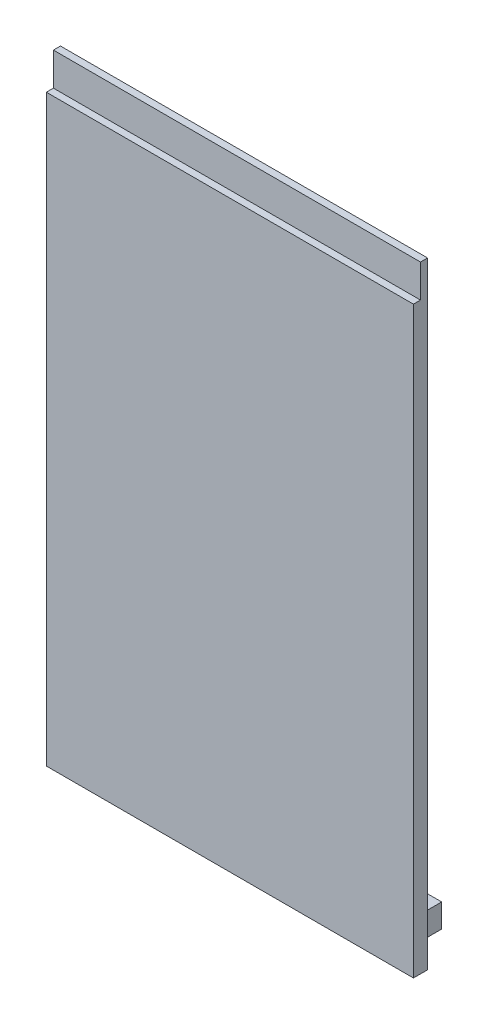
ISO-10303-21;
HEADER;
FILE_DESCRIPTION(('STEP AP214'),'2;1');
FILE_NAME('part.step','',(''),(''),'','','');
FILE_SCHEMA(('AUTOMOTIVE_DESIGN { 1 0 10303 214 1 1 1 1 }'));
ENDSEC;
DATA;
#1=APPLICATION_CONTEXT('core data for automotive mechanical design processes');
#2=APPLICATION_PROTOCOL_DEFINITION('international standard','automotive_design',2000,#1);
#3=PRODUCT_CONTEXT('',#1,'mechanical');
#4=PRODUCT('Part','Part','',(#3));
#5=PRODUCT_RELATED_PRODUCT_CATEGORY('part','',(#4));
#6=PRODUCT_DEFINITION_FORMATION('','',#4);
#7=PRODUCT_DEFINITION_CONTEXT('part definition',#1,'design');
#8=PRODUCT_DEFINITION('design','',#6,#7);
#9=PRODUCT_DEFINITION_SHAPE('','',#8);
#10=(LENGTH_UNIT() NAMED_UNIT(*) SI_UNIT(.MILLI.,.METRE.));
#11=(NAMED_UNIT(*) PLANE_ANGLE_UNIT() SI_UNIT($,.RADIAN.));
#12=(NAMED_UNIT(*) SI_UNIT($,.STERADIAN.) SOLID_ANGLE_UNIT());
#13=UNCERTAINTY_MEASURE_WITH_UNIT(LENGTH_MEASURE(1.E-05),#10,'distance_accuracy_value','');
#14=(GEOMETRIC_REPRESENTATION_CONTEXT(3) GLOBAL_UNCERTAINTY_ASSIGNED_CONTEXT((#13)) GLOBAL_UNIT_ASSIGNED_CONTEXT((#10,
#11,#12)) REPRESENTATION_CONTEXT('',''));
#15=CARTESIAN_POINT('',(0.,0.,0.));
#16=DIRECTION('',(0.,0.,1.));
#17=DIRECTION('',(1.,0.,0.));
#18=AXIS2_PLACEMENT_3D('',#15,#16,#17);
#19=CARTESIAN_POINT('',(0.,0.,0.));
#20=DIRECTION('',(0.,0.,1.));
#21=DIRECTION('',(1.,0.,0.));
#22=AXIS2_PLACEMENT_3D('',#19,#20,#21);
#23=PLANE('',#22);
#24=DIRECTION('',(-1.,0.,0.));
#25=VECTOR('',#24,1.);
#26=CARTESIAN_POINT('',(39.,-116.5,0.));
#27=LINE('',#26,#25);
#28=CARTESIAN_POINT('',(36.,-116.5,0.));
#29=VERTEX_POINT('',#28);
#30=CARTESIAN_POINT('',(-36.,-116.5,0.));
#31=VERTEX_POINT('',#30);
#32=EDGE_CURVE('E163',#29,#31,#27,.T.);
#33=ORIENTED_EDGE('',*,*,#32,.T.);
#34=DIRECTION('',(0.,-1.,0.));
#35=VECTOR('',#34,1.);
#36=CARTESIAN_POINT('',(-36.,124.5,0.));
#37=LINE('',#36,#35);
#38=CARTESIAN_POINT('',(-36.,-121.5,0.));
#39=VERTEX_POINT('',#38);
#40=EDGE_CURVE('E161',#31,#39,#37,.T.);
#41=ORIENTED_EDGE('',*,*,#40,.T.);
#42=DIRECTION('',(-1.,0.,0.));
#43=VECTOR('',#42,1.);
#44=CARTESIAN_POINT('',(39.,-121.5,0.));
#45=LINE('',#44,#43);
#46=CARTESIAN_POINT('',(36.,-121.5,0.));
#47=VERTEX_POINT('',#46);
#48=EDGE_CURVE('E169',#47,#39,#45,.T.);
#49=ORIENTED_EDGE('',*,*,#48,.F.);
#50=DIRECTION('',(0.,-1.,0.));
#51=VECTOR('',#50,1.);
#52=CARTESIAN_POINT('',(36.,124.5,0.));
#53=LINE('',#52,#51);
#54=EDGE_CURVE('E165',#29,#47,#53,.T.);
#55=ORIENTED_EDGE('',*,*,#54,.F.);
#56=EDGE_LOOP('',(#33,#41,#49,#55));
#57=FACE_BOUND('',#56,.T.);
#58=DIRECTION('',(0.,-1.,0.));
#59=VECTOR('',#58,1.);
#60=CARTESIAN_POINT('',(-39.,124.5,0.));
#61=LINE('',#60,#59);
#62=CARTESIAN_POINT('',(-39.,6.49999999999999,0.));
#63=VERTEX_POINT('',#62);
#64=CARTESIAN_POINT('',(-39.,-124.5,0.));
#65=VERTEX_POINT('',#64);
#66=EDGE_CURVE('E190',#63,#65,#61,.T.);
#67=ORIENTED_EDGE('',*,*,#66,.F.);
#68=DIRECTION('',(-1.,0.,0.));
#69=VECTOR('',#68,1.);
#70=CARTESIAN_POINT('',(39.,6.50000000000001,0.));
#71=LINE('',#70,#69);
#72=CARTESIAN_POINT('',(39.,6.50000000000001,0.));
#73=VERTEX_POINT('',#72);
#74=EDGE_CURVE('E122',#73,#63,#71,.T.);
#75=ORIENTED_EDGE('',*,*,#74,.F.);
#76=DIRECTION('',(0.,1.,0.));
#77=VECTOR('',#76,1.);
#78=CARTESIAN_POINT('',(39.,124.5,0.));
#79=LINE('',#78,#77);
#80=CARTESIAN_POINT('',(39.,-124.5,0.));
#81=VERTEX_POINT('',#80);
#82=EDGE_CURVE('E135',#81,#73,#79,.T.);
#83=ORIENTED_EDGE('',*,*,#82,.F.);
#84=DIRECTION('',(1.,0.,0.));
#85=VECTOR('',#84,1.);
#86=CARTESIAN_POINT('',(-39.,-124.5,0.));
#87=LINE('',#86,#85);
#88=EDGE_CURVE('E184',#65,#81,#87,.T.);
#89=ORIENTED_EDGE('',*,*,#88,.F.);
#90=EDGE_LOOP('',(#67,#75,#83,#89));
#91=FACE_BOUND('',#90,.T.);
#92=ADVANCED_FACE('F37',(#57,#91),#23,.F.);
#93=CARTESIAN_POINT('',(39.,124.5,3.));
#94=DIRECTION('',(-1.,0.,0.));
#95=DIRECTION('',(0.,-1.,0.));
#96=AXIS2_PLACEMENT_3D('',#93,#94,#95);
#97=PLANE('',#96);
#98=DIRECTION('',(0.,-1.,0.));
#99=VECTOR('',#98,1.);
#100=CARTESIAN_POINT('',(39.,-0.499999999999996,1.5));
#101=LINE('',#100,#99);
#102=CARTESIAN_POINT('',(39.,6.50000000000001,1.5));
#103=VERTEX_POINT('',#102);
#104=CARTESIAN_POINT('',(39.,-0.499999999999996,1.5));
#105=VERTEX_POINT('',#104);
#106=EDGE_CURVE('E125',#103,#105,#101,.T.);
#107=ORIENTED_EDGE('',*,*,#106,.T.);
#108=DIRECTION('',(0.,0.,1.));
#109=VECTOR('',#108,1.);
#110=CARTESIAN_POINT('',(39.,-0.499999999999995,3.));
#111=LINE('',#110,#109);
#112=CARTESIAN_POINT('',(39.,-0.499999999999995,3.));
#113=VERTEX_POINT('',#112);
#114=EDGE_CURVE('E130',#105,#113,#111,.T.);
#115=ORIENTED_EDGE('',*,*,#114,.T.);
#116=DIRECTION('',(0.,1.,0.));
#117=VECTOR('',#116,1.);
#118=CARTESIAN_POINT('',(39.,124.5,3.));
#119=LINE('',#118,#117);
#120=CARTESIAN_POINT('',(39.,-124.5,3.));
#121=VERTEX_POINT('',#120);
#122=EDGE_CURVE('E180',#121,#113,#119,.T.);
#123=ORIENTED_EDGE('',*,*,#122,.F.);
#124=DIRECTION('',(0.,0.,-1.));
#125=VECTOR('',#124,1.);
#126=CARTESIAN_POINT('',(39.,-124.5,3.));
#127=LINE('',#126,#125);
#128=EDGE_CURVE('E188',#121,#81,#127,.T.);
#129=ORIENTED_EDGE('',*,*,#128,.T.);
#130=ORIENTED_EDGE('',*,*,#82,.T.);
#131=DIRECTION('',(0.,0.,1.));
#132=VECTOR('',#131,1.);
#133=CARTESIAN_POINT('',(39.,6.50000000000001,1.5));
#134=LINE('',#133,#132);
#135=EDGE_CURVE('E54',#73,#103,#134,.T.);
#136=ORIENTED_EDGE('',*,*,#135,.T.);
#137=EDGE_LOOP('',(#107,#115,#123,#129,#130,#136));
#138=FACE_BOUND('',#137,.T.);
#139=ADVANCED_FACE('F39',(#138),#97,.F.);
#140=CARTESIAN_POINT('',(-39.,124.5,3.));
#141=DIRECTION('',(1.,0.,0.));
#142=DIRECTION('',(0.,1.,0.));
#143=AXIS2_PLACEMENT_3D('',#140,#141,#142);
#144=PLANE('',#143);
#145=DIRECTION('',(0.,-1.,0.));
#146=VECTOR('',#145,1.);
#147=CARTESIAN_POINT('',(-39.,124.5,3.));
#148=LINE('',#147,#146);
#149=CARTESIAN_POINT('',(-39.,-0.500000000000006,3.));
#150=VERTEX_POINT('',#149);
#151=CARTESIAN_POINT('',(-39.,-124.5,3.));
#152=VERTEX_POINT('',#151);
#153=EDGE_CURVE('E183',#150,#152,#148,.T.);
#154=ORIENTED_EDGE('',*,*,#153,.F.);
#155=DIRECTION('',(0.,0.,1.));
#156=VECTOR('',#155,1.);
#157=CARTESIAN_POINT('',(-39.,-0.500000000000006,3.));
#158=LINE('',#157,#156);
#159=CARTESIAN_POINT('',(-39.,-0.500000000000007,1.5));
#160=VERTEX_POINT('',#159);
#161=EDGE_CURVE('E136',#160,#150,#158,.T.);
#162=ORIENTED_EDGE('',*,*,#161,.F.);
#163=DIRECTION('',(0.,-1.,0.));
#164=VECTOR('',#163,1.);
#165=CARTESIAN_POINT('',(-39.,-0.500000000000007,1.5));
#166=LINE('',#165,#164);
#167=CARTESIAN_POINT('',(-39.,6.49999999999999,1.5));
#168=VERTEX_POINT('',#167);
#169=EDGE_CURVE('E138',#168,#160,#166,.T.);
#170=ORIENTED_EDGE('',*,*,#169,.F.);
#171=DIRECTION('',(0.,0.,1.));
#172=VECTOR('',#171,1.);
#173=CARTESIAN_POINT('',(-39.,6.49999999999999,1.5));
#174=LINE('',#173,#172);
#175=EDGE_CURVE('E117',#63,#168,#174,.T.);
#176=ORIENTED_EDGE('',*,*,#175,.F.);
#177=ORIENTED_EDGE('',*,*,#66,.T.);
#178=DIRECTION('',(0.,0.,-1.));
#179=VECTOR('',#178,1.);
#180=CARTESIAN_POINT('',(-39.,-124.5,3.));
#181=LINE('',#180,#179);
#182=EDGE_CURVE('E194',#152,#65,#181,.T.);
#183=ORIENTED_EDGE('',*,*,#182,.F.);
#184=EDGE_LOOP('',(#154,#162,#170,#176,#177,#183));
#185=FACE_BOUND('',#184,.T.);
#186=ADVANCED_FACE('F244',(#185),#144,.F.);
#187=CARTESIAN_POINT('',(-39.,-124.5,3.));
#188=DIRECTION('',(0.,1.,0.));
#189=DIRECTION('',(0.,0.,1.));
#190=AXIS2_PLACEMENT_3D('',#187,#188,#189);
#191=PLANE('',#190);
#192=ORIENTED_EDGE('',*,*,#88,.T.);
#193=ORIENTED_EDGE('',*,*,#128,.F.);
#194=DIRECTION('',(1.,0.,0.));
#195=VECTOR('',#194,1.);
#196=CARTESIAN_POINT('',(-39.,-124.5,3.));
#197=LINE('',#196,#195);
#198=EDGE_CURVE('E186',#152,#121,#197,.T.);
#199=ORIENTED_EDGE('',*,*,#198,.F.);
#200=ORIENTED_EDGE('',*,*,#182,.T.);
#201=EDGE_LOOP('',(#192,#193,#199,#200));
#202=FACE_BOUND('',#201,.T.);
#203=ADVANCED_FACE('F248',(#202),#191,.F.);
#204=CARTESIAN_POINT('',(0.,0.,3.));
#205=DIRECTION('',(0.,0.,1.));
#206=DIRECTION('',(1.,0.,0.));
#207=AXIS2_PLACEMENT_3D('',#204,#205,#206);
#208=PLANE('',#207);
#209=DIRECTION('',(-1.,0.,0.));
#210=VECTOR('',#209,1.);
#211=CARTESIAN_POINT('',(39.,-0.499999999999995,3.));
#212=LINE('',#211,#210);
#213=EDGE_CURVE('E144',#113,#150,#212,.T.);
#214=ORIENTED_EDGE('',*,*,#213,.T.);
#215=ORIENTED_EDGE('',*,*,#153,.T.);
#216=ORIENTED_EDGE('',*,*,#198,.T.);
#217=ORIENTED_EDGE('',*,*,#122,.T.);
#218=EDGE_LOOP('',(#214,#215,#216,#217));
#219=FACE_BOUND('',#218,.T.);
#220=ADVANCED_FACE('F247',(#219),#208,.T.);
#221=CARTESIAN_POINT('',(39.,-121.5,0.));
#222=DIRECTION('',(0.,-1.,0.));
#223=DIRECTION('',(1.,0.,0.));
#224=AXIS2_PLACEMENT_3D('',#221,#222,#223);
#225=PLANE('',#224);
#226=CARTESIAN_POINT('',(-31.,-121.5,-3.));
#227=DIRECTION('',(0.,-1.,0.));
#228=DIRECTION('',(1.,0.,0.));
#229=AXIS2_PLACEMENT_3D('',#226,#227,#228);
#230=CIRCLE('',#229,1.5);
#231=CARTESIAN_POINT('',(-29.5,-121.5,-3.));
#232=VERTEX_POINT('',#231);
#233=EDGE_CURVE('E150',#232,#232,#230,.T.);
#234=ORIENTED_EDGE('',*,*,#233,.F.);
#235=EDGE_LOOP('',(#234));
#236=FACE_BOUND('',#235,.T.);
#237=CARTESIAN_POINT('',(31.,-121.5,-3.));
#238=DIRECTION('',(0.,-1.,0.));
#239=DIRECTION('',(1.,0.,0.));
#240=AXIS2_PLACEMENT_3D('',#237,#238,#239);
#241=CIRCLE('',#240,1.5);
#242=CARTESIAN_POINT('',(32.5,-121.5,-3.));
#243=VERTEX_POINT('',#242);
#244=EDGE_CURVE('E147',#243,#243,#241,.T.);
#245=ORIENTED_EDGE('',*,*,#244,.F.);
#246=EDGE_LOOP('',(#245));
#247=FACE_BOUND('',#246,.T.);
#248=DIRECTION('',(0.,0.,1.));
#249=VECTOR('',#248,1.);
#250=CARTESIAN_POINT('',(-36.,-121.5,0.));
#251=LINE('',#250,#249);
#252=CARTESIAN_POINT('',(-36.,-121.5,-6.));
#253=VERTEX_POINT('',#252);
#254=EDGE_CURVE('E156',#253,#39,#251,.T.);
#255=ORIENTED_EDGE('',*,*,#254,.F.);
#256=DIRECTION('',(-1.,0.,0.));
#257=VECTOR('',#256,1.);
#258=CARTESIAN_POINT('',(39.,-121.5,-6.));
#259=LINE('',#258,#257);
#260=CARTESIAN_POINT('',(36.,-121.5,-6.));
#261=VERTEX_POINT('',#260);
#262=EDGE_CURVE('E172',#261,#253,#259,.T.);
#263=ORIENTED_EDGE('',*,*,#262,.F.);
#264=DIRECTION('',(0.,0.,-1.));
#265=VECTOR('',#264,1.);
#266=CARTESIAN_POINT('',(36.,-121.5,-6.));
#267=LINE('',#266,#265);
#268=EDGE_CURVE('E160',#47,#261,#267,.T.);
#269=ORIENTED_EDGE('',*,*,#268,.F.);
#270=ORIENTED_EDGE('',*,*,#48,.T.);
#271=EDGE_LOOP('',(#255,#263,#269,#270));
#272=FACE_BOUND('',#271,.T.);
#273=ADVANCED_FACE('F226',(#236,#247,#272),#225,.T.);
#274=CARTESIAN_POINT('',(39.,-121.5,-6.));
#275=DIRECTION('',(0.,0.,-1.));
#276=DIRECTION('',(-1.,0.,0.));
#277=AXIS2_PLACEMENT_3D('',#274,#275,#276);
#278=PLANE('',#277);
#279=DIRECTION('',(0.,-1.,0.));
#280=VECTOR('',#279,1.);
#281=CARTESIAN_POINT('',(-36.,124.5,-6.));
#282=LINE('',#281,#280);
#283=CARTESIAN_POINT('',(-36.,-116.5,-6.));
#284=VERTEX_POINT('',#283);
#285=EDGE_CURVE('E159',#284,#253,#282,.T.);
#286=ORIENTED_EDGE('',*,*,#285,.F.);
#287=DIRECTION('',(-1.,0.,0.));
#288=VECTOR('',#287,1.);
#289=CARTESIAN_POINT('',(39.,-116.5,-6.));
#290=LINE('',#289,#288);
#291=CARTESIAN_POINT('',(36.,-116.5,-6.));
#292=VERTEX_POINT('',#291);
#293=EDGE_CURVE('E175',#292,#284,#290,.T.);
#294=ORIENTED_EDGE('',*,*,#293,.F.);
#295=DIRECTION('',(0.,-1.,0.));
#296=VECTOR('',#295,1.);
#297=CARTESIAN_POINT('',(36.,124.5,-6.));
#298=LINE('',#297,#296);
#299=EDGE_CURVE('E62',#292,#261,#298,.T.);
#300=ORIENTED_EDGE('',*,*,#299,.T.);
#301=ORIENTED_EDGE('',*,*,#262,.T.);
#302=EDGE_LOOP('',(#286,#294,#300,#301));
#303=FACE_BOUND('',#302,.T.);
#304=ADVANCED_FACE('F210',(#303),#278,.T.);
#305=CARTESIAN_POINT('',(39.,-116.5,-6.));
#306=DIRECTION('',(0.,1.,0.));
#307=DIRECTION('',(-1.,0.,0.));
#308=AXIS2_PLACEMENT_3D('',#305,#306,#307);
#309=PLANE('',#308);
#310=CARTESIAN_POINT('',(-31.,-116.5,-3.));
#311=DIRECTION('',(0.,1.,0.));
#312=DIRECTION('',(-1.,0.,0.));
#313=AXIS2_PLACEMENT_3D('',#310,#311,#312);
#314=CIRCLE('',#313,1.5);
#315=CARTESIAN_POINT('',(-32.5,-116.5,-3.));
#316=VERTEX_POINT('',#315);
#317=EDGE_CURVE('E41',#316,#316,#314,.T.);
#318=ORIENTED_EDGE('',*,*,#317,.F.);
#319=EDGE_LOOP('',(#318));
#320=FACE_BOUND('',#319,.T.);
#321=CARTESIAN_POINT('',(31.,-116.5,-3.));
#322=DIRECTION('',(0.,1.,0.));
#323=DIRECTION('',(-1.,0.,0.));
#324=AXIS2_PLACEMENT_3D('',#321,#322,#323);
#325=CIRCLE('',#324,1.5);
#326=CARTESIAN_POINT('',(29.5,-116.5,-3.));
#327=VERTEX_POINT('',#326);
#328=EDGE_CURVE('E153',#327,#327,#325,.T.);
#329=ORIENTED_EDGE('',*,*,#328,.F.);
#330=EDGE_LOOP('',(#329));
#331=FACE_BOUND('',#330,.T.);
#332=DIRECTION('',(0.,0.,-1.));
#333=VECTOR('',#332,1.);
#334=CARTESIAN_POINT('',(-36.,-116.5,-6.));
#335=LINE('',#334,#333);
#336=EDGE_CURVE('E11',#31,#284,#335,.T.);
#337=ORIENTED_EDGE('',*,*,#336,.F.);
#338=ORIENTED_EDGE('',*,*,#32,.F.);
#339=DIRECTION('',(0.,0.,1.));
#340=VECTOR('',#339,1.);
#341=CARTESIAN_POINT('',(36.,-116.5,-6.));
#342=LINE('',#341,#340);
#343=EDGE_CURVE('E46',#292,#29,#342,.T.);
#344=ORIENTED_EDGE('',*,*,#343,.F.);
#345=ORIENTED_EDGE('',*,*,#293,.T.);
#346=EDGE_LOOP('',(#337,#338,#344,#345));
#347=FACE_BOUND('',#346,.T.);
#348=ADVANCED_FACE('F206',(#320,#331,#347),#309,.T.);
#349=CARTESIAN_POINT('',(36.,124.5,-6.));
#350=DIRECTION('',(-1.,0.,0.));
#351=DIRECTION('',(0.,-1.,0.));
#352=AXIS2_PLACEMENT_3D('',#349,#350,#351);
#353=PLANE('',#352);
#354=ORIENTED_EDGE('',*,*,#343,.T.);
#355=ORIENTED_EDGE('',*,*,#54,.T.);
#356=ORIENTED_EDGE('',*,*,#268,.T.);
#357=ORIENTED_EDGE('',*,*,#299,.F.);
#358=EDGE_LOOP('',(#354,#355,#356,#357));
#359=FACE_BOUND('',#358,.T.);
#360=ADVANCED_FACE('F209',(#359),#353,.F.);
#361=CARTESIAN_POINT('',(-36.,124.5,0.));
#362=DIRECTION('',(1.,0.,0.));
#363=DIRECTION('',(0.,1.,0.));
#364=AXIS2_PLACEMENT_3D('',#361,#362,#363);
#365=PLANE('',#364);
#366=ORIENTED_EDGE('',*,*,#336,.T.);
#367=ORIENTED_EDGE('',*,*,#285,.T.);
#368=ORIENTED_EDGE('',*,*,#254,.T.);
#369=ORIENTED_EDGE('',*,*,#40,.F.);
#370=EDGE_LOOP('',(#366,#367,#368,#369));
#371=FACE_BOUND('',#370,.T.);
#372=ADVANCED_FACE('F228',(#371),#365,.F.);
#373=CARTESIAN_POINT('',(31.,124.5,-3.));
#374=DIRECTION('',(0.,-1.,0.));
#375=DIRECTION('',(1.,0.,0.));
#376=AXIS2_PLACEMENT_3D('',#373,#374,#375);
#377=CYLINDRICAL_SURFACE('',#376,1.5);
#378=ORIENTED_EDGE('',*,*,#328,.T.);
#379=EDGE_LOOP('',(#378));
#380=FACE_BOUND('',#379,.T.);
#381=ORIENTED_EDGE('',*,*,#244,.T.);
#382=EDGE_LOOP('',(#381));
#383=FACE_BOUND('',#382,.T.);
#384=ADVANCED_FACE('F230',(#380,#383),#377,.F.);
#385=CARTESIAN_POINT('',(-31.,124.5,-3.));
#386=DIRECTION('',(0.,-1.,0.));
#387=DIRECTION('',(1.,0.,0.));
#388=AXIS2_PLACEMENT_3D('',#385,#386,#387);
#389=CYLINDRICAL_SURFACE('',#388,1.5);
#390=ORIENTED_EDGE('',*,*,#317,.T.);
#391=EDGE_LOOP('',(#390));
#392=FACE_BOUND('',#391,.T.);
#393=ORIENTED_EDGE('',*,*,#233,.T.);
#394=EDGE_LOOP('',(#393));
#395=FACE_BOUND('',#394,.T.);
#396=ADVANCED_FACE('F203',(#392,#395),#389,.F.);
#397=CARTESIAN_POINT('',(39.,-0.499999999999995,3.));
#398=DIRECTION('',(0.,-1.,0.));
#399=DIRECTION('',(0.,0.,-1.));
#400=AXIS2_PLACEMENT_3D('',#397,#398,#399);
#401=PLANE('',#400);
#402=ORIENTED_EDGE('',*,*,#161,.T.);
#403=ORIENTED_EDGE('',*,*,#213,.F.);
#404=ORIENTED_EDGE('',*,*,#114,.F.);
#405=DIRECTION('',(-1.,0.,0.));
#406=VECTOR('',#405,1.);
#407=CARTESIAN_POINT('',(39.,-0.499999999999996,1.5));
#408=LINE('',#407,#406);
#409=EDGE_CURVE('E121',#105,#160,#408,.T.);
#410=ORIENTED_EDGE('',*,*,#409,.T.);
#411=EDGE_LOOP('',(#402,#403,#404,#410));
#412=FACE_BOUND('',#411,.T.);
#413=ADVANCED_FACE('F264',(#412),#401,.F.);
#414=CARTESIAN_POINT('',(39.,-0.499999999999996,1.5));
#415=DIRECTION('',(0.,0.,-1.));
#416=DIRECTION('',(-1.,0.,0.));
#417=AXIS2_PLACEMENT_3D('',#414,#415,#416);
#418=PLANE('',#417);
#419=ORIENTED_EDGE('',*,*,#169,.T.);
#420=ORIENTED_EDGE('',*,*,#409,.F.);
#421=ORIENTED_EDGE('',*,*,#106,.F.);
#422=DIRECTION('',(-1.,0.,0.));
#423=VECTOR('',#422,1.);
#424=CARTESIAN_POINT('',(39.,6.50000000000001,1.5));
#425=LINE('',#424,#423);
#426=EDGE_CURVE('E113',#103,#168,#425,.T.);
#427=ORIENTED_EDGE('',*,*,#426,.T.);
#428=EDGE_LOOP('',(#419,#420,#421,#427));
#429=FACE_BOUND('',#428,.T.);
#430=ADVANCED_FACE('F126',(#429),#418,.F.);
#431=CARTESIAN_POINT('',(39.,6.50000000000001,1.5));
#432=DIRECTION('',(0.,-1.,0.));
#433=DIRECTION('',(1.,0.,0.));
#434=AXIS2_PLACEMENT_3D('',#431,#432,#433);
#435=PLANE('',#434);
#436=ORIENTED_EDGE('',*,*,#175,.T.);
#437=ORIENTED_EDGE('',*,*,#426,.F.);
#438=ORIENTED_EDGE('',*,*,#135,.F.);
#439=ORIENTED_EDGE('',*,*,#74,.T.);
#440=EDGE_LOOP('',(#436,#437,#438,#439));
#441=FACE_BOUND('',#440,.T.);
#442=ADVANCED_FACE('F115',(#441),#435,.F.);
#443=CLOSED_SHELL('',(#92,#139,#186,#203,#220,#273,#304,#348,#360,#372,#384,#396,#413,#430,#442));
#444=MANIFOLD_SOLID_BREP('B2',#443);
#445=ADVANCED_BREP_SHAPE_REPRESENTATION('',(#18,#444),#14);
#446=SHAPE_DEFINITION_REPRESENTATION(#9,#445);
ENDSEC;
END-ISO-10303-21;
